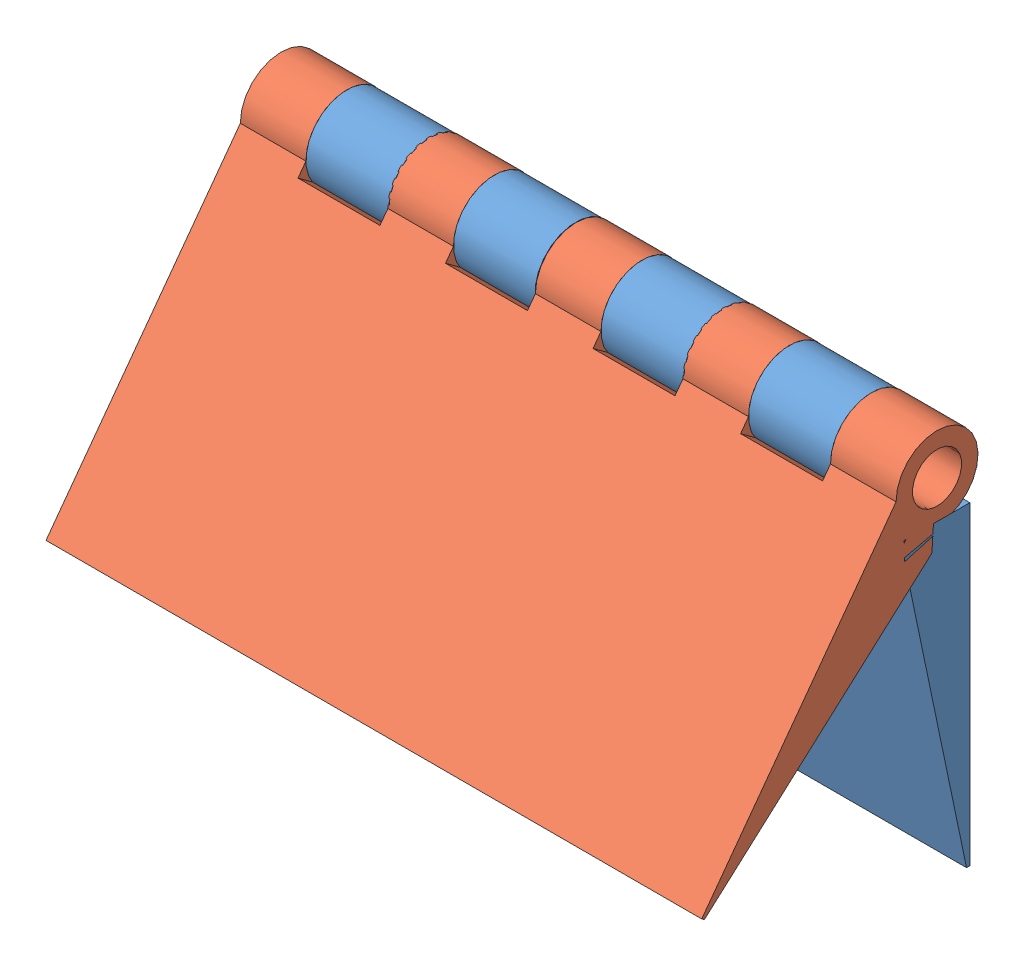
SolidWorks assembly Assem1.sldasm, configuration Default (file format 11000). Lengths in mm.
Overall size (40 26.41 18.25).
2 component instances, 2 part files, 2 mates.
Components (placement in the parent):
- hing2-1: hing2.SLDPRT [Default] at (-2.8414 24.4886 37.6261) size (40 26.41 5)
- hing1-1: hing1.SLDPRT [Default] at (37.1586 26.7264 44.4424) x (-1 0 0) z (0 -0.592722 -0.805407) size (40 24 5)
Mates (geometry in assembly coordinates):
- Concentric1: concentric: cylinder of hing2-1 through (44.2297 35.9886 37.6261) axis (-1 0 0) radius 1.5; cylinder of hing1-1 through (-9.9125 35.9886 37.6261) axis (1 0 0) radius 1.5
- Coincident1: coincident: circle of hing2-1; circle of hing1-1
